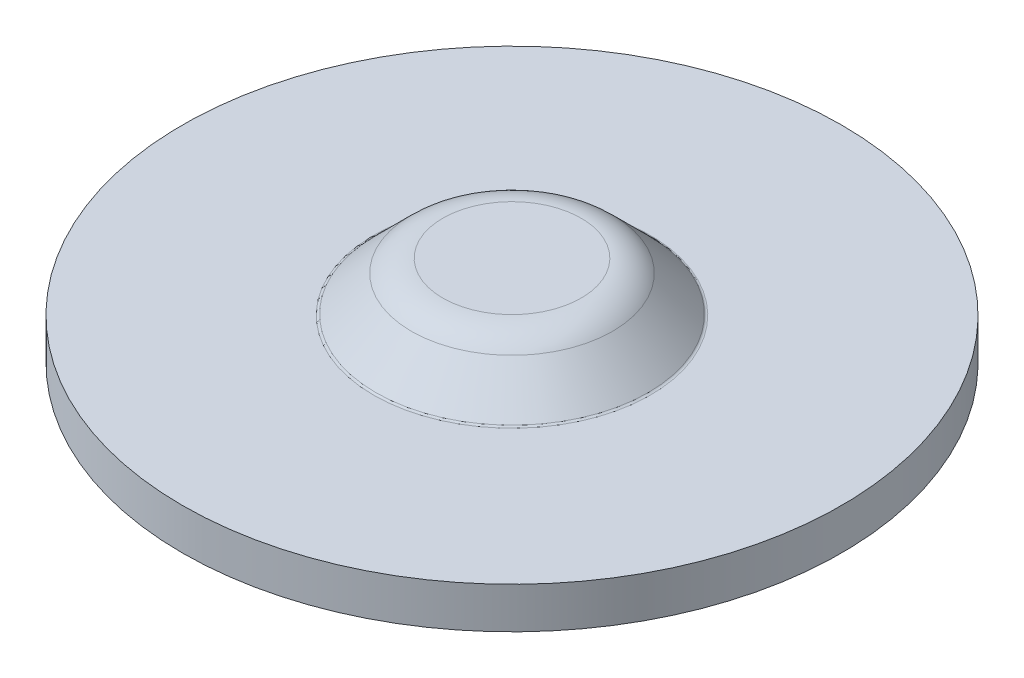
ISO-10303-21;
HEADER;
FILE_DESCRIPTION(('STEP AP214'),'2;1');
FILE_NAME('part.step','',(''),(''),'','','');
FILE_SCHEMA(('AUTOMOTIVE_DESIGN { 1 0 10303 214 1 1 1 1 }'));
ENDSEC;
DATA;
#1=APPLICATION_CONTEXT('core data for automotive mechanical design processes');
#2=APPLICATION_PROTOCOL_DEFINITION('international standard','automotive_design',2000,#1);
#3=PRODUCT_CONTEXT('',#1,'mechanical');
#4=PRODUCT('Part','Part','',(#3));
#5=PRODUCT_RELATED_PRODUCT_CATEGORY('part','',(#4));
#6=PRODUCT_DEFINITION_FORMATION('','',#4);
#7=PRODUCT_DEFINITION_CONTEXT('part definition',#1,'design');
#8=PRODUCT_DEFINITION('design','',#6,#7);
#9=PRODUCT_DEFINITION_SHAPE('','',#8);
#10=(LENGTH_UNIT() NAMED_UNIT(*) SI_UNIT(.MILLI.,.METRE.));
#11=(NAMED_UNIT(*) PLANE_ANGLE_UNIT() SI_UNIT($,.RADIAN.));
#12=(NAMED_UNIT(*) SI_UNIT($,.STERADIAN.) SOLID_ANGLE_UNIT());
#13=UNCERTAINTY_MEASURE_WITH_UNIT(LENGTH_MEASURE(1.E-05),#10,'distance_accuracy_value','');
#14=(GEOMETRIC_REPRESENTATION_CONTEXT(3) GLOBAL_UNCERTAINTY_ASSIGNED_CONTEXT((#13)) GLOBAL_UNIT_ASSIGNED_CONTEXT((#10,
#11,#12)) REPRESENTATION_CONTEXT('',''));
#15=CARTESIAN_POINT('',(0.,0.,0.));
#16=DIRECTION('',(0.,0.,1.));
#17=DIRECTION('',(1.,0.,0.));
#18=AXIS2_PLACEMENT_3D('',#15,#16,#17);
#19=CARTESIAN_POINT('',(0.,0.,0.));
#20=DIRECTION('',(0.,-1.,0.));
#21=DIRECTION('',(0.,0.,-1.));
#22=AXIS2_PLACEMENT_3D('',#19,#20,#21);
#23=PLANE('',#22);
#24=CARTESIAN_POINT('',(0.,0.,0.));
#25=DIRECTION('',(0.,1.,0.));
#26=DIRECTION('',(0.,0.,1.));
#27=AXIS2_PLACEMENT_3D('',#24,#25,#26);
#28=CIRCLE('',#27,5.334);
#29=CARTESIAN_POINT('',(0.,0.,5.334));
#30=VERTEX_POINT('',#29);
#31=EDGE_CURVE('E23',#30,#30,#28,.F.);
#32=ORIENTED_EDGE('',*,*,#31,.F.);
#33=EDGE_LOOP('',(#32));
#34=FACE_BOUND('',#33,.T.);
#35=ADVANCED_FACE('F18',(#34),#23,.F.);
#36=CARTESIAN_POINT('',(0.,-3.429,0.));
#37=DIRECTION('',(0.,1.,0.));
#38=DIRECTION('',(0.,0.,1.));
#39=AXIS2_PLACEMENT_3D('',#36,#37,#38);
#40=TOROIDAL_SURFACE('',#39,5.334,3.429);
#41=CARTESIAN_POINT('',(0.,-1.00433084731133,0.));
#42=DIRECTION('',(0.,-1.,0.));
#43=DIRECTION('',(0.,0.,-1.));
#44=AXIS2_PLACEMENT_3D('',#41,#42,#43);
#45=CIRCLE('',#44,7.75866915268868);
#46=CARTESIAN_POINT('',(0.,-1.00433084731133,-7.75866915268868));
#47=VERTEX_POINT('',#46);
#48=EDGE_CURVE('E44',#47,#47,#45,.T.);
#49=ORIENTED_EDGE('',*,*,#48,.F.);
#50=EDGE_LOOP('',(#49));
#51=FACE_BOUND('',#50,.T.);
#52=ORIENTED_EDGE('',*,*,#31,.T.);
#53=EDGE_LOOP('',(#52));
#54=FACE_BOUND('',#53,.T.);
#55=ADVANCED_FACE('F70',(#51,#54),#40,.T.);
#56=CARTESIAN_POINT('',(0.,-3.175,0.));
#57=DIRECTION('',(0.,1.,0.));
#58=DIRECTION('',(0.,0.,1.));
#59=AXIS2_PLACEMENT_3D('',#56,#57,#58);
#60=PLANE('',#59);
#61=CARTESIAN_POINT('',(0.,-3.175,0.));
#62=DIRECTION('',(0.,1.,0.));
#63=DIRECTION('',(0.,0.,1.));
#64=AXIS2_PLACEMENT_3D('',#61,#62,#63);
#65=CIRCLE('',#64,5.334);
#66=CARTESIAN_POINT('',(0.,-3.175,5.334));
#67=VERTEX_POINT('',#66);
#68=EDGE_CURVE('E58',#67,#67,#65,.F.);
#69=ORIENTED_EDGE('',*,*,#68,.T.);
#70=EDGE_LOOP('',(#69));
#71=FACE_BOUND('',#70,.T.);
#72=ADVANCED_FACE('F77',(#71),#60,.F.);
#73=CARTESIAN_POINT('',(0.,-3.73560512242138,0.));
#74=DIRECTION('',(0.,-1.,0.));
#75=DIRECTION('',(0.,0.,-1.));
#76=AXIS2_PLACEMENT_3D('',#73,#74,#75);
#77=CONICAL_SURFACE('',#76,10.4899434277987,0.785398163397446);
#78=ORIENTED_EDGE('',*,*,#48,.T.);
#79=EDGE_LOOP('',(#78));
#80=FACE_BOUND('',#79,.T.);
#81=CARTESIAN_POINT('',(0.,-3.73560512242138,0.));
#82=DIRECTION('',(0.,1.,0.));
#83=DIRECTION('',(0.,0.,-1.));
#84=AXIS2_PLACEMENT_3D('',#81,#82,#83);
#85=CIRCLE('',#84,10.4899434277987);
#86=CARTESIAN_POINT('',(0.,-3.73560512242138,-10.4899434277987));
#87=VERTEX_POINT('',#86);
#88=EDGE_CURVE('E60',#87,#87,#85,.T.);
#89=ORIENTED_EDGE('',*,*,#88,.T.);
#90=EDGE_LOOP('',(#89));
#91=FACE_BOUND('',#90,.T.);
#92=ADVANCED_FACE('F101',(#80,#91),#77,.T.);
#93=CARTESIAN_POINT('',(0.,-3.429,0.));
#94=DIRECTION('',(0.,1.,0.));
#95=DIRECTION('',(0.,0.,1.));
#96=AXIS2_PLACEMENT_3D('',#93,#94,#95);
#97=TOROIDAL_SURFACE('',#96,5.334,0.254000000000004);
#98=ORIENTED_EDGE('',*,*,#68,.F.);
#99=EDGE_LOOP('',(#98));
#100=FACE_BOUND('',#99,.T.);
#101=CARTESIAN_POINT('',(0.,-3.2493948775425,0.));
#102=DIRECTION('',(0.,-1.,0.));
#103=DIRECTION('',(0.,0.,-1.));
#104=AXIS2_PLACEMENT_3D('',#101,#102,#103);
#105=CIRCLE('',#104,5.5136051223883);
#106=CARTESIAN_POINT('',(0.,-3.2493948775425,-5.5136051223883));
#107=VERTEX_POINT('',#106);
#108=EDGE_CURVE('E57',#107,#107,#105,.T.);
#109=ORIENTED_EDGE('',*,*,#108,.T.);
#110=EDGE_LOOP('',(#109));
#111=FACE_BOUND('',#110,.T.);
#112=ADVANCED_FACE('F103',(#100,#111),#97,.F.);
#113=CARTESIAN_POINT('',(0.,-3.556,0.));
#114=DIRECTION('',(0.,1.,0.));
#115=DIRECTION('',(0.,0.,1.));
#116=AXIS2_PLACEMENT_3D('',#113,#114,#115);
#117=TOROIDAL_SURFACE('',#116,10.6695485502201,0.253999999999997);
#118=CARTESIAN_POINT('',(0.,-3.81,0.));
#119=DIRECTION('',(0.,1.,0.));
#120=DIRECTION('',(0.,0.,1.));
#121=AXIS2_PLACEMENT_3D('',#118,#119,#120);
#122=CIRCLE('',#121,10.6695485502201);
#123=CARTESIAN_POINT('',(0.,-3.81,10.6695485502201));
#124=VERTEX_POINT('',#123);
#125=EDGE_CURVE('E55',#124,#124,#122,.T.);
#126=ORIENTED_EDGE('',*,*,#125,.T.);
#127=EDGE_LOOP('',(#126));
#128=FACE_BOUND('',#127,.T.);
#129=ORIENTED_EDGE('',*,*,#88,.F.);
#130=EDGE_LOOP('',(#129));
#131=FACE_BOUND('',#130,.T.);
#132=ADVANCED_FACE('F99',(#128,#131),#117,.F.);
#133=CARTESIAN_POINT('',(0.,-5.98066915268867,0.));
#134=DIRECTION('',(0.,-1.,0.));
#135=DIRECTION('',(0.,0.,-1.));
#136=AXIS2_PLACEMENT_3D('',#133,#134,#135);
#137=CONICAL_SURFACE('',#136,8.24487939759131,0.785398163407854);
#138=CARTESIAN_POINT('',(0.,-5.98066915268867,0.));
#139=DIRECTION('',(0.,1.,0.));
#140=DIRECTION('',(0.,0.,-1.));
#141=AXIS2_PLACEMENT_3D('',#138,#139,#140);
#142=CIRCLE('',#141,8.24487939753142);
#143=CARTESIAN_POINT('',(0.,-5.98066915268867,-8.24487939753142));
#144=VERTEX_POINT('',#143);
#145=EDGE_CURVE('E54',#144,#144,#142,.T.);
#146=ORIENTED_EDGE('',*,*,#145,.F.);
#147=EDGE_LOOP('',(#146));
#148=FACE_BOUND('',#147,.T.);
#149=ORIENTED_EDGE('',*,*,#108,.F.);
#150=EDGE_LOOP('',(#149));
#151=FACE_BOUND('',#150,.T.);
#152=ADVANCED_FACE('F95',(#148,#151),#137,.F.);
#153=CARTESIAN_POINT('',(10.6695485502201,-3.81,0.));
#154=DIRECTION('',(0.,-1.,0.));
#155=DIRECTION('',(0.,0.,-1.));
#156=AXIS2_PLACEMENT_3D('',#153,#154,#155);
#157=PLANE('',#156);
#158=CARTESIAN_POINT('',(0.,-3.81,0.));
#159=DIRECTION('',(0.,1.,0.));
#160=DIRECTION('',(0.,0.,1.));
#161=AXIS2_PLACEMENT_3D('',#158,#159,#160);
#162=CIRCLE('',#161,25.4);
#163=CARTESIAN_POINT('',(0.,-3.81,25.4));
#164=VERTEX_POINT('',#163);
#165=EDGE_CURVE('E39',#164,#164,#162,.F.);
#166=ORIENTED_EDGE('',*,*,#165,.F.);
#167=EDGE_LOOP('',(#166));
#168=FACE_BOUND('',#167,.T.);
#169=ORIENTED_EDGE('',*,*,#125,.F.);
#170=EDGE_LOOP('',(#169));
#171=FACE_BOUND('',#170,.T.);
#172=ADVANCED_FACE('F92',(#168,#171),#157,.F.);
#173=CARTESIAN_POINT('',(0.,-3.55600000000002,0.));
#174=DIRECTION('',(0.,1.,0.));
#175=DIRECTION('',(-1.,0.,0.));
#176=AXIS2_PLACEMENT_3D('',#173,#174,#175);
#177=TOROIDAL_SURFACE('',#176,10.6695485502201,3.42899999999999);
#178=ORIENTED_EDGE('',*,*,#145,.T.);
#179=EDGE_LOOP('',(#178));
#180=FACE_BOUND('',#179,.T.);
#181=CARTESIAN_POINT('',(0.,-6.985,10.6695485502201));
#182=CARTESIAN_POINT('',(-0.155271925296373,-6.98499999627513,10.6695690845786));
#183=CARTESIAN_POINT('',(-0.310529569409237,-6.9849999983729,10.6661851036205));
#184=CARTESIAN_POINT('',(-0.620753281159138,-6.98500000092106,10.6526792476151));
#185=CARTESIAN_POINT('',(-0.775719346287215,-6.98500000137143,10.6425573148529));
#186=CARTESIAN_POINT('',(-1.12376156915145,-6.98499998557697,10.612283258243));
#187=CARTESIAN_POINT('',(-1.31668101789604,-6.9849999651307,10.5902563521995));
#188=CARTESIAN_POINT('',(-1.58311969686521,-6.98499995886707,10.5522532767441));
#189=CARTESIAN_POINT('',(-1.65731552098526,-6.98499995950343,10.5408490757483));
#190=CARTESIAN_POINT('',(-1.90566971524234,-6.98499996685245,10.4999518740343));
#191=CARTESIAN_POINT('',(-2.07924951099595,-6.98499998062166,10.4668619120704));
#192=CARTESIAN_POINT('',(-2.44722846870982,-6.9849999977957,10.3871986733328));
#193=CARTESIAN_POINT('',(-2.64136936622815,-6.98499999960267,10.3394256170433));
#194=CARTESIAN_POINT('',(-2.88526702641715,-6.98500000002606,10.2721725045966));
#195=CARTESIAN_POINT('',(-2.93642498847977,-6.98500000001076,10.2576581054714));
#196=CARTESIAN_POINT('',(-3.08194137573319,-6.98499999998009,10.2152092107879));
#197=CARTESIAN_POINT('',(-3.17603466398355,-6.98499999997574,10.1863604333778));
#198=CARTESIAN_POINT('',(-3.45705572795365,-6.98499999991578,10.0959155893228));
#199=CARTESIAN_POINT('',(-3.64274256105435,-6.98499999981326,10.0304163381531));
#200=CARTESIAN_POINT('',(-4.01020042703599,-6.98499999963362,9.88925348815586));
#201=CARTESIAN_POINT('',(-4.19197145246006,-6.98499999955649,9.81358986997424));
#202=CARTESIAN_POINT('',(-4.55105056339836,-6.9849999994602,9.65231847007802));
#203=CARTESIAN_POINT('',(-4.72835864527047,-6.98499999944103,9.56671068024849));
#204=CARTESIAN_POINT('',(-5.07796630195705,-6.98499999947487,9.38581580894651));
#205=CARTESIAN_POINT('',(-5.25026587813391,-6.98499999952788,9.29052873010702));
#206=CARTESIAN_POINT('',(-5.58932692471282,-6.98499999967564,9.09056899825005));
#207=CARTESIAN_POINT('',(-5.75608840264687,-6.98499999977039,8.98589635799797));
#208=CARTESIAN_POINT('',(-6.0835703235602,-6.98499999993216,8.76747718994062));
#209=CARTESIAN_POINT('',(-6.24429078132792,-6.98499999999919,8.65373068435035));
#210=CARTESIAN_POINT('',(-6.49349362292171,-6.98500000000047,8.46680784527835));
#211=CARTESIAN_POINT('',(-6.58414309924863,-6.98499999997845,8.3965006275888));
#212=CARTESIAN_POINT('',(-6.76313352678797,-6.98499999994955,8.25300178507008));
#213=CARTESIAN_POINT('',(-6.85147448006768,-6.98499999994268,8.17981016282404));
#214=CARTESIAN_POINT('',(-7.02575246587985,-6.98499999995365,8.03061944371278));
#215=CARTESIAN_POINT('',(-7.11168949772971,-6.9849999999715,7.95462034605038));
#216=CARTESIAN_POINT('',(-7.2810701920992,-6.98500000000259,7.799894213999));
#217=CARTESIAN_POINT('',(-7.36451385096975,-6.98500000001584,7.72116717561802));
#218=CARTESIAN_POINT('',(-7.54525603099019,-6.98499999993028,7.54505399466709));
#219=CARTESIAN_POINT('',(-7.64198815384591,-6.98499999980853,7.44708486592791));
#220=CARTESIAN_POINT('',(-7.8045214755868,-6.98499999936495,7.27597516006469));
#221=CARTESIAN_POINT('',(-7.87126968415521,-6.98499999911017,7.2037303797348));
#222=CARTESIAN_POINT('',(-8.01917563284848,-6.98499999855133,7.03912965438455));
#223=CARTESIAN_POINT('',(-8.09976434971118,-6.98499999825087,6.94626091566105));
#224=CARTESIAN_POINT('',(-8.25767981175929,-6.98499999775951,6.75779210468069));
#225=CARTESIAN_POINT('',(-8.33500655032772,-6.9849999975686,6.66219202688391));
#226=CARTESIAN_POINT('',(-8.48630646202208,-6.98499999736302,6.46837331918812));
#227=CARTESIAN_POINT('',(-8.56027963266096,-6.98499999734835,6.37015468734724));
#228=CARTESIAN_POINT('',(-8.70478354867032,-6.98499999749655,6.17121712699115));
#229=CARTESIAN_POINT('',(-8.77531429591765,-6.98499999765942,6.07049819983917));
#230=CARTESIAN_POINT('',(-8.91284847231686,-6.98499999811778,5.86668045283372));
#231=CARTESIAN_POINT('',(-8.97985190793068,-6.98499999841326,5.76358163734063));
#232=CARTESIAN_POINT('',(-9.11025277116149,-6.98499999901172,5.55512846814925));
#233=CARTESIAN_POINT('',(-9.17365021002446,-6.9849999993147,5.44977412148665));
#234=CARTESIAN_POINT('',(-9.29675702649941,-6.98499999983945,5.23693344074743));
#235=CARTESIAN_POINT('',(-9.35646642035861,-6.98500000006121,5.12944711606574));
#236=CARTESIAN_POINT('',(-9.4763986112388,-6.98499999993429,4.90451001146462));
#237=CARTESIAN_POINT('',(-9.53633677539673,-6.98499999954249,4.78690737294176));
#238=CARTESIAN_POINT('',(-9.65904679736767,-6.98500000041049,4.53473647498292));
#239=CARTESIAN_POINT('',(-9.72123650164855,-6.98500000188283,4.39988488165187));
#240=CARTESIAN_POINT('',(-9.84002742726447,-6.98499999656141,4.12773218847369));
#241=CARTESIAN_POINT('',(-9.8966285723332,-6.98499998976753,3.9904310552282));
#242=CARTESIAN_POINT('',(-9.97473165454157,-6.98499998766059,3.78878335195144));
#243=CARTESIAN_POINT('',(-9.99859135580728,-6.9849999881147,3.72534111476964));
#244=CARTESIAN_POINT('',(-10.0720383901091,-6.98499999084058,3.52420412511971));
#245=CARTESIAN_POINT('',(-10.1193888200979,-6.98499999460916,3.38568363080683));
#246=CARTESIAN_POINT('',(-10.2037392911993,-6.98499999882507,3.12127864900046));
#247=CARTESIAN_POINT('',(-10.241303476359,-6.98499999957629,2.99557343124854));
#248=CARTESIAN_POINT('',(-10.2990647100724,-6.98500000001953,2.78852381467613));
#249=CARTESIAN_POINT('',(-10.3206333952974,-6.98499999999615,2.70755906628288));
#250=CARTESIAN_POINT('',(-10.3831101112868,-6.98500000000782,2.46152041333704));
#251=CARTESIAN_POINT('',(-10.4210627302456,-6.98500000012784,2.2956855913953));
#252=CARTESIAN_POINT('',(-10.4890120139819,-6.98499999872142,1.96238921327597));
#253=CARTESIAN_POINT('',(-10.5190086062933,-6.98499999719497,1.7949276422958));
#254=CARTESIAN_POINT('',(-10.5527886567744,-6.98499999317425,1.57644035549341));
#255=CARTESIAN_POINT('',(-10.5602234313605,-6.98499999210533,1.52596232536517));
#256=CARTESIAN_POINT('',(-10.5743788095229,-6.9849999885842,1.42490495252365));
#257=CARTESIAN_POINT('',(-10.581099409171,-6.98499998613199,1.37432560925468));
#258=CARTESIAN_POINT('',(-10.59666374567,-6.98499998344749,1.25008604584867));
#259=CARTESIAN_POINT('',(-10.6050860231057,-6.98499998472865,1.17637312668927));
#260=CARTESIAN_POINT('',(-10.6278419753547,-6.98499998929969,0.956820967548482));
#261=CARTESIAN_POINT('',(-10.6399311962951,-6.98499999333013,0.81074307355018));
#262=CARTESIAN_POINT('',(-10.6573906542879,-6.98499999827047,0.529315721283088));
#263=CARTESIAN_POINT('',(-10.6632011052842,-6.98499999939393,0.393993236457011));
#264=CARTESIAN_POINT('',(-10.6685203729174,-6.98500000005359,0.172425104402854));
#265=CARTESIAN_POINT('',(-10.6695517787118,-6.98500000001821,0.0862132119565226));
#266=CARTESIAN_POINT('',(-10.6695445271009,-6.98499999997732,-0.107432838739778));
#267=CARTESIAN_POINT('',(-10.6679338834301,-6.98499999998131,-0.214867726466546));
#268=CARTESIAN_POINT('',(-10.661459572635,-6.98499999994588,-0.429638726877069));
#269=CARTESIAN_POINT('',(-10.656595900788,-6.98499999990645,-0.536974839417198));
#270=CARTESIAN_POINT('',(-10.6436310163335,-6.98499999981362,-0.751451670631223));
#271=CARTESIAN_POINT('',(-10.6355297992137,-6.98499999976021,-0.858592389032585));
#272=CARTESIAN_POINT('',(-10.6160942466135,-6.98499999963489,-1.07258029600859));
#273=CARTESIAN_POINT('',(-10.6047599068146,-6.98499999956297,-1.179427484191));
#274=CARTESIAN_POINT('',(-10.5788692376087,-6.98499999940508,-1.39273091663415));
#275=CARTESIAN_POINT('',(-10.5643129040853,-6.9849999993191,-1.49918716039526));
#276=CARTESIAN_POINT('',(-10.5319913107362,-6.98499999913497,-1.71161152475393));
#277=CARTESIAN_POINT('',(-10.5142260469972,-6.98499999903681,-1.81757964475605));
#278=CARTESIAN_POINT('',(-10.4755028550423,-6.98499999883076,-2.02893106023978));
#279=CARTESIAN_POINT('',(-10.4545449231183,-6.98499999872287,-2.13431435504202));
#280=CARTESIAN_POINT('',(-10.4094554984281,-6.98499999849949,-2.34439994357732));
#281=CARTESIAN_POINT('',(-10.3853240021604,-6.984999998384,-2.44910223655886));
#282=CARTESIAN_POINT('',(-10.3339094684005,-6.98499999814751,-2.65773026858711));
#283=CARTESIAN_POINT('',(-10.3066264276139,-6.98499999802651,-2.761656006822));
#284=CARTESIAN_POINT('',(-10.2489336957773,-6.98499999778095,-2.96863608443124));
#285=CARTESIAN_POINT('',(-10.2185240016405,-6.98499999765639,-3.07169042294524));
#286=CARTESIAN_POINT('',(-10.1546057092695,-6.98499999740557,-3.27683365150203));
#287=CARTESIAN_POINT('',(-10.121097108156,-6.9849999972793,-3.3789225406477));
#288=CARTESIAN_POINT('',(-10.0510115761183,-6.9849999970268,-3.58204170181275));
#289=CARTESIAN_POINT('',(-10.0144346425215,-6.98499999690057,-3.68307197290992));
#290=CARTESIAN_POINT('',(-9.93824582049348,-6.98499999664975,-3.88398169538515));
#291=CARTESIAN_POINT('',(-9.89863392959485,-6.98499999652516,-3.98386114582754));
#292=CARTESIAN_POINT('',(-9.81641133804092,-6.98499999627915,-4.18237807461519));
#293=CARTESIAN_POINT('',(-9.77380063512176,-6.98499999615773,-4.28101555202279));
#294=CARTESIAN_POINT('',(-9.68561930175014,-6.98499999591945,-4.47695851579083));
#295=CARTESIAN_POINT('',(-9.64004866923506,-6.98499999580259,-4.57426400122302));
#296=CARTESIAN_POINT('',(-9.54598906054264,-6.98499999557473,-4.76745417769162));
#297=CARTESIAN_POINT('',(-9.49750008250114,-6.98499999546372,-4.86333886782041));
#298=CARTESIAN_POINT('',(-9.39764803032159,-6.98499999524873,-5.05359994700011));
#299=CARTESIAN_POINT('',(-9.34628495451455,-6.98499999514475,-5.1479763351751));
#300=CARTESIAN_POINT('',(-9.24073157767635,-6.98499999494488,-5.33513468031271));
#301=CARTESIAN_POINT('',(-9.1865412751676,-6.98499999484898,-5.427916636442));
#302=CARTESIAN_POINT('',(-9.075382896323,-6.98499999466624,-5.61180144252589));
#303=CARTESIAN_POINT('',(-9.0184148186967,-6.98499999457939,-5.70290429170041));
#304=CARTESIAN_POINT('',(-8.90175287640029,-6.98499999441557,-5.88334774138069));
#305=CARTESIAN_POINT('',(-8.84205901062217,-6.98499999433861,-5.97268834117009));
#306=CARTESIAN_POINT('',(-8.71999996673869,-6.98499999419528,-6.14952575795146));
#307=CARTESIAN_POINT('',(-8.65763478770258,-6.98499999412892,-6.237022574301));
#308=CARTESIAN_POINT('',(-8.53029003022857,-6.98499999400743,-6.41009257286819));
#309=CARTESIAN_POINT('',(-8.46531045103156,-6.9849999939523,-6.4956657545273));
#310=CARTESIAN_POINT('',(-8.33279619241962,-6.98499999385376,-6.66481038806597));
#311=CARTESIAN_POINT('',(-8.26526151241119,-6.98499999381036,-6.74838183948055));
#312=CARTESIAN_POINT('',(-8.12769868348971,-6.98499999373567,-6.91344674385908));
#313=CARTESIAN_POINT('',(-8.05767053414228,-6.98499999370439,-6.99494019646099));
#314=CARTESIAN_POINT('',(-7.91518467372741,-6.98499999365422,-7.15577473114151));
#315=CARTESIAN_POINT('',(-7.84272696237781,-6.98499999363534,-7.23511581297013));
#316=CARTESIAN_POINT('',(-7.69544810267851,-6.98499999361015,-7.39157319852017));
#317=CARTESIAN_POINT('',(-7.62062695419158,-6.98499999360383,-7.46868950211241));
#318=CARTESIAN_POINT('',(-7.46868950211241,-6.98499999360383,-7.62062695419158));
#319=CARTESIAN_POINT('',(-7.39157319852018,-6.98499999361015,-7.69544810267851));
#320=CARTESIAN_POINT('',(-7.23511581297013,-6.98499999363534,-7.8427269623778));
#321=CARTESIAN_POINT('',(-7.15577473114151,-6.98499999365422,-7.91518467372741));
#322=CARTESIAN_POINT('',(-6.994940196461,-6.98499999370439,-8.05767053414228));
#323=CARTESIAN_POINT('',(-6.91344674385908,-6.98499999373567,-8.12769868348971));
#324=CARTESIAN_POINT('',(-6.74838183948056,-6.98499999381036,-8.26526151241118));
#325=CARTESIAN_POINT('',(-6.66481038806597,-6.98499999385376,-8.33279619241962));
#326=CARTESIAN_POINT('',(-6.4956657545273,-6.9849999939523,-8.46531045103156));
#327=CARTESIAN_POINT('',(-6.4100925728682,-6.98499999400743,-8.53029003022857));
#328=CARTESIAN_POINT('',(-6.237022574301,-6.98499999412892,-8.65763478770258));
#329=CARTESIAN_POINT('',(-6.14952575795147,-6.98499999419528,-8.71999996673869));
#330=CARTESIAN_POINT('',(-5.9726883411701,-6.98499999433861,-8.84205901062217));
#331=CARTESIAN_POINT('',(-5.8833477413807,-6.98499999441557,-8.90175287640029));
#332=CARTESIAN_POINT('',(-5.70290429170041,-6.98499999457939,-9.0184148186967));
#333=CARTESIAN_POINT('',(-5.61180144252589,-6.98499999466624,-9.075382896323));
#334=CARTESIAN_POINT('',(-5.427916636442,-6.98499999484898,-9.1865412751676));
#335=CARTESIAN_POINT('',(-5.33513468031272,-6.98499999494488,-9.24073157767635));
#336=CARTESIAN_POINT('',(-5.1479763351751,-6.98499999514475,-9.34628495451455));
#337=CARTESIAN_POINT('',(-5.05359994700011,-6.98499999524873,-9.3976480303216));
#338=CARTESIAN_POINT('',(-4.86333886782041,-6.98499999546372,-9.49750008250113));
#339=CARTESIAN_POINT('',(-4.76745417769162,-6.98499999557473,-9.54598906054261));
#340=CARTESIAN_POINT('',(-4.57426400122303,-6.9849999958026,-9.64004866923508));
#341=CARTESIAN_POINT('',(-4.47695851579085,-6.98499999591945,-9.68561930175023));
#342=CARTESIAN_POINT('',(-4.28101555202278,-6.98499999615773,-9.77380063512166));
#343=CARTESIAN_POINT('',(-4.18237807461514,-6.98499999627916,-9.81641133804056));
#344=CARTESIAN_POINT('',(-3.98386114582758,-6.98499999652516,-9.89863392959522));
#345=CARTESIAN_POINT('',(-3.88398169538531,-6.98499999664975,-9.93824582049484));
#346=CARTESIAN_POINT('',(-3.68307197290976,-6.98499999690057,-10.0144346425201));
#347=CARTESIAN_POINT('',(-3.58204170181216,-6.9849999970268,-10.0510115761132));
#348=CARTESIAN_POINT('',(-3.37892254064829,-6.98499999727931,-10.121097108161));
#349=CARTESIAN_POINT('',(-3.27683365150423,-6.98499999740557,-10.1546057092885));
#350=CARTESIAN_POINT('',(-3.07169042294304,-6.98499999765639,-10.2185240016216));
#351=CARTESIAN_POINT('',(-2.96863608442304,-6.98499999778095,-10.2489336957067));
#352=CARTESIAN_POINT('',(-2.7616560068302,-6.98499999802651,-10.3066264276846));
#353=CARTESIAN_POINT('',(-2.65773026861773,-6.98499999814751,-10.3339094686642));
#354=CARTESIAN_POINT('',(-2.44910223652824,-6.984999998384,-10.3853240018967));
#355=CARTESIAN_POINT('',(-2.34439994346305,-6.98499999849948,-10.4094554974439));
#356=CARTESIAN_POINT('',(-2.13431435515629,-6.98499999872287,-10.4545449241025));
#357=CARTESIAN_POINT('',(-2.02893106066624,-6.98499999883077,-10.4755028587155));
#358=CARTESIAN_POINT('',(-1.81757964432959,-6.9849999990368,-10.514226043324));
#359=CARTESIAN_POINT('',(-1.71161152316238,-6.98499999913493,-10.5319912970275));
#360=CARTESIAN_POINT('',(-1.49918716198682,-6.98499999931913,-10.5643129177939));
#361=CARTESIAN_POINT('',(-1.3927309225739,-6.9849999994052,-10.5788692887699));
#362=CARTESIAN_POINT('',(-1.17942747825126,-6.98499999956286,-10.6047598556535));
#363=CARTESIAN_POINT('',(-1.0725802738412,-6.98499999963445,-10.6160940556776));
#364=CARTESIAN_POINT('',(-0.858592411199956,-6.98499999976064,-10.6355299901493));
#365=CARTESIAN_POINT('',(-0.751451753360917,-6.98499999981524,-10.6436317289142));
#366=CARTESIAN_POINT('',(-0.536974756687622,-6.98499999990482,-10.6565951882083));
#367=CARTESIAN_POINT('',(-0.429638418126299,-6.98499999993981,-10.661456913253));
#368=CARTESIAN_POINT('',(-0.21486803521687,-6.98499999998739,-10.6679365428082));
#369=CARTESIAN_POINT('',(-0.10743399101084,-6.98499999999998,-10.669554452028));
#370=CARTESIAN_POINT('',(0.,-6.985,-10.6695485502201));
#371=B_SPLINE_CURVE_WITH_KNOTS('',3,(#181,#182,#183,#184,#185,#186,#187,#188,#189,#190,#191,
#192,#193,#194,#195,#196,#197,#198,#199,#200,#201,#202,#203,#204,#205,#206,#207,#208,#209,#210,
#211,#212,#213,#214,#215,#216,#217,#218,#219,#220,#221,#222,#223,#224,#225,#226,#227,#228,#229,
#230,#231,#232,#233,#234,#235,#236,#237,#238,#239,#240,#241,#242,#243,#244,#245,#246,#247,#248,
#249,#250,#251,#252,#253,#254,#255,#256,#257,#258,#259,#260,#261,#262,#263,#264,#265,#266,#267,
#268,#269,#270,#271,#272,#273,#274,#275,#276,#277,#278,#279,#280,#281,#282,#283,#284,#285,#286,
#287,#288,#289,#290,#291,#292,#293,#294,#295,#296,#297,#298,#299,#300,#301,#302,#303,#304,#305,
#306,#307,#308,#309,#310,#311,#312,#313,#314,#315,#316,#317,#318,#319,#320,#321,#322,#323,#324,
#325,#326,#327,#328,#329,#330,#331,#332,#333,#334,#335,#336,#337,#338,#339,#340,#341,#342,#343,
#344,#345,#346,#347,#348,#349,#350,#351,#352,#353,#354,#355,#356,#357,#358,#359,#360,#361,#362,
#363,#364,#365,#366,#367,#368,#369,#370),.UNSPECIFIED.,.F.,.F.,(4,2,2,2,2,2,2,2,2,2,2,2,2,2,2,2,
2,2,2,2,2,2,2,2,2,2,2,2,2,2,2,2,2,2,2,2,2,2,2,2,2,2,2,2,2,2,2,2,2,2,2,2,2,2,2,2,2,2,2,2,2,2,2,2,
2,2,2,2,2,2,2,2,2,2,2,2,2,2,2,2,2,2,2,2,2,2,2,2,2,2,2,2,2,2,4),(0.,0.465750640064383,
0.931505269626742,1.5136849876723,1.73887627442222,2.26876110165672,2.86820665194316,
3.02773513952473,3.32294990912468,3.91332414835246,4.50369951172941,5.09407535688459,
5.68445104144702,6.27482592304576,6.86519935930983,7.20930433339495,7.55340899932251,
7.89751376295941,8.24161903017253,8.65453872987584,8.94958498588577,9.31838725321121,
9.6871902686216,10.0559935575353,10.4247966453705,10.7935990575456,11.162400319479,
11.5311999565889,11.9270975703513,12.3724768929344,12.8178622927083,13.0211956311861,
13.4602262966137,13.8537290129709,14.1050765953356,14.6152392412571,15.1254065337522,
15.2784713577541,15.4315370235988,15.6540999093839,16.0936963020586,16.4999375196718,
16.7585700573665,17.0808597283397,17.4031498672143,17.7254404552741,18.0477314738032,
18.3700229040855,18.6923147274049,19.0146069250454,19.3368994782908,19.6591923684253,
19.9814855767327,20.3037790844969,20.6260728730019,20.9483669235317,21.2706612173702,
21.5929557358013,21.915250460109,22.2375453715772,22.55984045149,22.8821356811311,
23.2044310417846,23.5267265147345,23.8490220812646,24.1713177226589,24.4936134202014,
24.815909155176,25.1382049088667,25.4605006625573,25.7827963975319,26.1050920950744,
26.4273877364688,26.7496833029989,27.0719787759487,27.3942741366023,27.7165693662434,
28.0388644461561,28.3611593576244,28.6834540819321,29.0057486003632,29.3280428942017,
29.6503369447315,29.9726307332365,30.2949242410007,30.6172174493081,30.9395103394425,
31.261802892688,31.5840950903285,31.9063869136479,32.2286783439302,32.5509693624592,
32.8732599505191,33.1955500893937,33.5178397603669),.UNSPECIFIED.);
#372=CARTESIAN_POINT('',(0.,-6.985,10.6695485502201));
#373=VERTEX_POINT('',#372);
#374=CARTESIAN_POINT('',(0.,-6.985,-10.6695485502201));
#375=VERTEX_POINT('',#374);
#376=EDGE_CURVE('E28',#373,#375,#371,.T.);
#377=ORIENTED_EDGE('',*,*,#376,.T.);
#378=CARTESIAN_POINT('',(0.,-6.985,0.));
#379=DIRECTION('',(0.,1.,0.));
#380=DIRECTION('',(-1.,0.,0.));
#381=AXIS2_PLACEMENT_3D('',#378,#379,#380);
#382=CIRCLE('',#381,10.6695485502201);
#383=EDGE_CURVE('E36',#375,#373,#382,.F.);
#384=ORIENTED_EDGE('',*,*,#383,.T.);
#385=EDGE_LOOP('',(#377,#384));
#386=FACE_BOUND('',#385,.T.);
#387=ADVANCED_FACE('F20',(#180,#386),#177,.T.);
#388=CARTESIAN_POINT('',(0.,-6.9862539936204,0.));
#389=DIRECTION('',(0.,1.,0.));
#390=DIRECTION('',(0.,0.,1.));
#391=AXIS2_PLACEMENT_3D('',#388,#389,#390);
#392=CYLINDRICAL_SURFACE('',#391,25.4);
#393=ORIENTED_EDGE('',*,*,#165,.T.);
#394=EDGE_LOOP('',(#393));
#395=FACE_BOUND('',#394,.T.);
#396=CARTESIAN_POINT('',(0.,-6.985,0.));
#397=DIRECTION('',(0.,1.,0.));
#398=DIRECTION('',(0.,0.,1.));
#399=AXIS2_PLACEMENT_3D('',#396,#397,#398);
#400=CIRCLE('',#399,25.4);
#401=CARTESIAN_POINT('',(0.,-6.985,25.4));
#402=VERTEX_POINT('',#401);
#403=EDGE_CURVE('E11',#402,#402,#400,.T.);
#404=ORIENTED_EDGE('',*,*,#403,.T.);
#405=EDGE_LOOP('',(#404));
#406=FACE_BOUND('',#405,.T.);
#407=ADVANCED_FACE('F82',(#395,#406),#392,.T.);
#408=CARTESIAN_POINT('',(10.6695485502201,-6.985,0.));
#409=DIRECTION('',(0.,1.,0.));
#410=DIRECTION('',(0.,0.,1.));
#411=AXIS2_PLACEMENT_3D('',#408,#409,#410);
#412=PLANE('',#411);
#413=ORIENTED_EDGE('',*,*,#403,.F.);
#414=EDGE_LOOP('',(#413));
#415=FACE_BOUND('',#414,.T.);
#416=ORIENTED_EDGE('',*,*,#383,.F.);
#417=ORIENTED_EDGE('',*,*,#376,.F.);
#418=EDGE_LOOP('',(#416,#417));
#419=FACE_BOUND('',#418,.T.);
#420=ADVANCED_FACE('F37',(#415,#419),#412,.F.);
#421=CLOSED_SHELL('',(#35,#55,#72,#92,#112,#132,#152,#172,#387,#407,#420));
#422=MANIFOLD_SOLID_BREP('B1',#421);
#423=ADVANCED_BREP_SHAPE_REPRESENTATION('',(#18,#422),#14);
#424=SHAPE_DEFINITION_REPRESENTATION(#9,#423);
ENDSEC;
END-ISO-10303-21;
